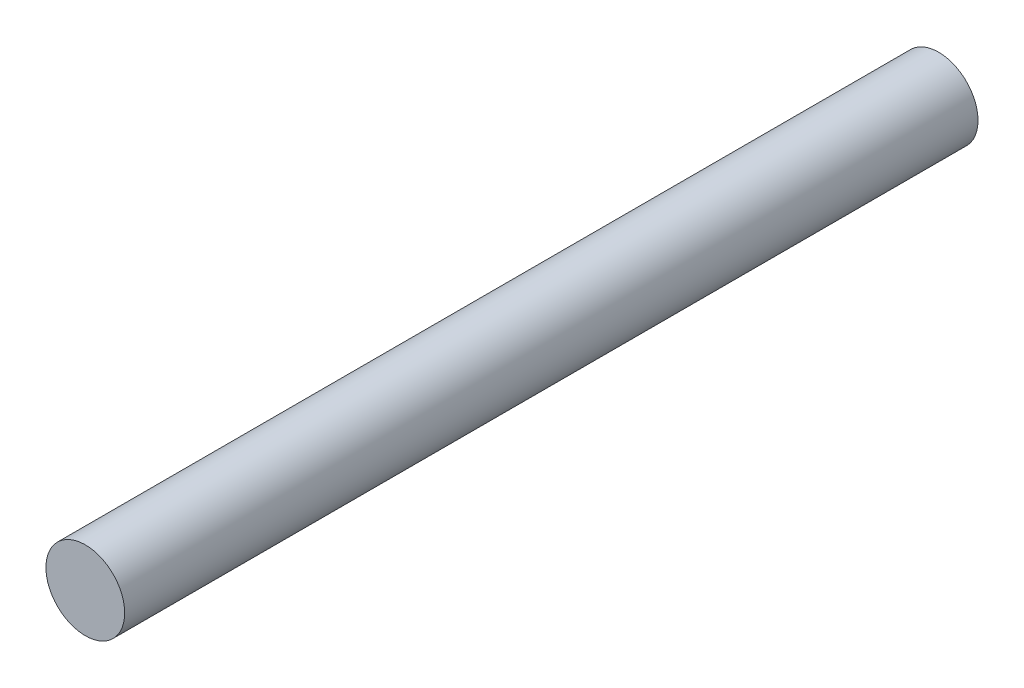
ISO-10303-21;
HEADER;
FILE_DESCRIPTION(('STEP AP214'),'2;1');
FILE_NAME('part.step','',(''),(''),'','','');
FILE_SCHEMA(('AUTOMOTIVE_DESIGN { 1 0 10303 214 1 1 1 1 }'));
ENDSEC;
DATA;
#1=APPLICATION_CONTEXT('core data for automotive mechanical design processes');
#2=APPLICATION_PROTOCOL_DEFINITION('international standard','automotive_design',2000,#1);
#3=PRODUCT_CONTEXT('',#1,'mechanical');
#4=PRODUCT('Part','Part','',(#3));
#5=PRODUCT_RELATED_PRODUCT_CATEGORY('part','',(#4));
#6=PRODUCT_DEFINITION_FORMATION('','',#4);
#7=PRODUCT_DEFINITION_CONTEXT('part definition',#1,'design');
#8=PRODUCT_DEFINITION('design','',#6,#7);
#9=PRODUCT_DEFINITION_SHAPE('','',#8);
#10=(LENGTH_UNIT() NAMED_UNIT(*) SI_UNIT(.MILLI.,.METRE.));
#11=(NAMED_UNIT(*) PLANE_ANGLE_UNIT() SI_UNIT($,.RADIAN.));
#12=(NAMED_UNIT(*) SI_UNIT($,.STERADIAN.) SOLID_ANGLE_UNIT());
#13=UNCERTAINTY_MEASURE_WITH_UNIT(LENGTH_MEASURE(1.E-05),#10,'distance_accuracy_value','');
#14=(GEOMETRIC_REPRESENTATION_CONTEXT(3) GLOBAL_UNCERTAINTY_ASSIGNED_CONTEXT((#13)) GLOBAL_UNIT_ASSIGNED_CONTEXT((#10,
#11,#12)) REPRESENTATION_CONTEXT('',''));
#15=CARTESIAN_POINT('',(0.,0.,0.));
#16=DIRECTION('',(0.,0.,1.));
#17=DIRECTION('',(1.,0.,0.));
#18=AXIS2_PLACEMENT_3D('',#15,#16,#17);
#19=CARTESIAN_POINT('',(0.,0.,-650.));
#20=DIRECTION('',(0.,0.,1.));
#21=DIRECTION('',(1.,0.,0.));
#22=AXIS2_PLACEMENT_3D('',#19,#20,#21);
#23=CYLINDRICAL_SURFACE('',#22,30.);
#24=CARTESIAN_POINT('',(0.,0.,-650.));
#25=DIRECTION('',(0.,0.,1.));
#26=DIRECTION('',(1.,0.,0.));
#27=AXIS2_PLACEMENT_3D('',#24,#25,#26);
#28=CIRCLE('',#27,30.);
#29=CARTESIAN_POINT('',(30.,0.,-650.));
#30=VERTEX_POINT('',#29);
#31=EDGE_CURVE('E10',#30,#30,#28,.T.);
#32=ORIENTED_EDGE('',*,*,#31,.T.);
#33=EDGE_LOOP('',(#32));
#34=FACE_BOUND('',#33,.T.);
#35=CARTESIAN_POINT('',(0.,0.,0.));
#36=DIRECTION('',(0.,0.,1.));
#37=DIRECTION('',(1.,0.,0.));
#38=AXIS2_PLACEMENT_3D('',#35,#36,#37);
#39=CIRCLE('',#38,30.);
#40=CARTESIAN_POINT('',(30.,0.,0.));
#41=VERTEX_POINT('',#40);
#42=EDGE_CURVE('E40',#41,#41,#39,.T.);
#43=ORIENTED_EDGE('',*,*,#42,.F.);
#44=EDGE_LOOP('',(#43));
#45=FACE_BOUND('',#44,.T.);
#46=ADVANCED_FACE('F37',(#34,#45),#23,.T.);
#47=CARTESIAN_POINT('',(0.,0.,-650.));
#48=DIRECTION('',(0.,0.,1.));
#49=DIRECTION('',(1.,0.,0.));
#50=AXIS2_PLACEMENT_3D('',#47,#48,#49);
#51=PLANE('',#50);
#52=ORIENTED_EDGE('',*,*,#31,.F.);
#53=EDGE_LOOP('',(#52));
#54=FACE_BOUND('',#53,.T.);
#55=ADVANCED_FACE('F54',(#54),#51,.F.);
#56=CARTESIAN_POINT('',(0.,0.,0.));
#57=DIRECTION('',(0.,0.,1.));
#58=DIRECTION('',(1.,0.,0.));
#59=AXIS2_PLACEMENT_3D('',#56,#57,#58);
#60=PLANE('',#59);
#61=ORIENTED_EDGE('',*,*,#42,.T.);
#62=EDGE_LOOP('',(#61));
#63=FACE_BOUND('',#62,.T.);
#64=ADVANCED_FACE('F51',(#63),#60,.T.);
#65=CLOSED_SHELL('',(#46,#55,#64));
#66=MANIFOLD_SOLID_BREP('B2',#65);
#67=ADVANCED_BREP_SHAPE_REPRESENTATION('',(#18,#66),#14);
#68=SHAPE_DEFINITION_REPRESENTATION(#9,#67);
ENDSEC;
END-ISO-10303-21;
